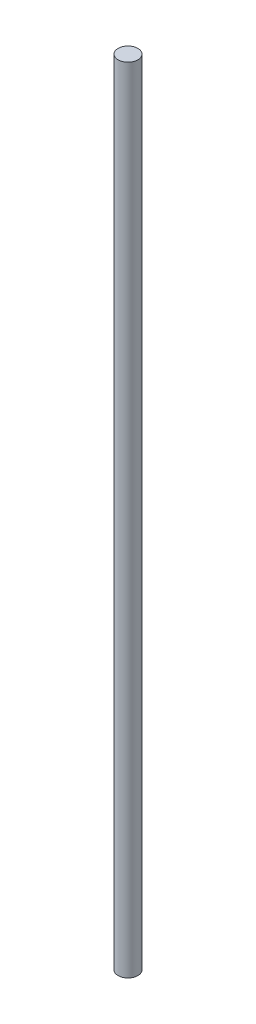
from build123d import *

# Parameters (mm, degrees)
SKETCH1_W = 0.5
SKETCH1_H = 40


with BuildPart() as part:
    # Sketch1 → Revolve1 (revolve)
    with BuildSketch(Plane.XY, mode=Mode.PRIVATE) as revolve1_sk:
        with Locations((0.25, 20)):
            Rectangle(SKETCH1_W, SKETCH1_H)
    revolve(revolve1_sk.sketch.rotate(Axis((0, 55.263459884, 0), (0, -1, 0)), 90), axis=Axis((0, 55.263459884, 0), (0, -1, 0)))


solid = part.part
